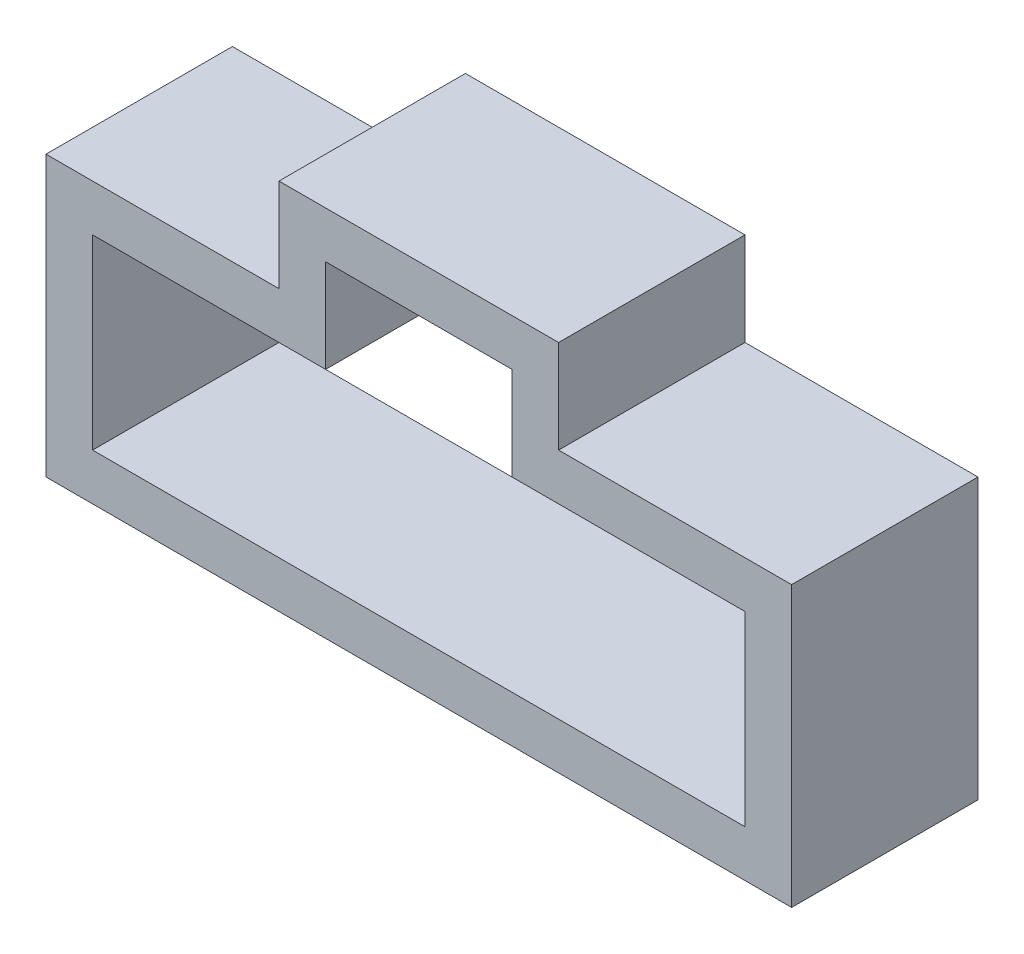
ISO-10303-21;
HEADER;
FILE_DESCRIPTION(('STEP AP214'),'2;1');
FILE_NAME('part.step','',(''),(''),'','','');
FILE_SCHEMA(('AUTOMOTIVE_DESIGN { 1 0 10303 214 1 1 1 1 }'));
ENDSEC;
DATA;
#1=APPLICATION_CONTEXT('core data for automotive mechanical design processes');
#2=APPLICATION_PROTOCOL_DEFINITION('international standard','automotive_design',2000,#1);
#3=PRODUCT_CONTEXT('',#1,'mechanical');
#4=PRODUCT('Part','Part','',(#3));
#5=PRODUCT_RELATED_PRODUCT_CATEGORY('part','',(#4));
#6=PRODUCT_DEFINITION_FORMATION('','',#4);
#7=PRODUCT_DEFINITION_CONTEXT('part definition',#1,'design');
#8=PRODUCT_DEFINITION('design','',#6,#7);
#9=PRODUCT_DEFINITION_SHAPE('','',#8);
#10=(LENGTH_UNIT() NAMED_UNIT(*) SI_UNIT(.MILLI.,.METRE.));
#11=(NAMED_UNIT(*) PLANE_ANGLE_UNIT() SI_UNIT($,.RADIAN.));
#12=(NAMED_UNIT(*) SI_UNIT($,.STERADIAN.) SOLID_ANGLE_UNIT());
#13=UNCERTAINTY_MEASURE_WITH_UNIT(LENGTH_MEASURE(1.E-05),#10,'distance_accuracy_value','');
#14=(GEOMETRIC_REPRESENTATION_CONTEXT(3) GLOBAL_UNCERTAINTY_ASSIGNED_CONTEXT((#13)) GLOBAL_UNIT_ASSIGNED_CONTEXT((#10,
#11,#12)) REPRESENTATION_CONTEXT('',''));
#15=CARTESIAN_POINT('',(0.,0.,0.));
#16=DIRECTION('',(0.,0.,1.));
#17=DIRECTION('',(1.,0.,0.));
#18=AXIS2_PLACEMENT_3D('',#15,#16,#17);
#19=CARTESIAN_POINT('',(22.5,-2.5,10.));
#20=DIRECTION('',(0.,0.,-1.));
#21=DIRECTION('',(-1.,0.,0.));
#22=AXIS2_PLACEMENT_3D('',#19,#20,#21);
#23=PLANE('',#22);
#24=DIRECTION('',(1.,0.,0.));
#25=VECTOR('',#24,1.);
#26=CARTESIAN_POINT('',(0.,-2.5,10.));
#27=LINE('',#26,#25);
#28=CARTESIAN_POINT('',(-2.5,-2.5,10.));
#29=VERTEX_POINT('',#28);
#30=CARTESIAN_POINT('',(77.5,-2.49999999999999,10.));
#31=VERTEX_POINT('',#30);
#32=EDGE_CURVE('E274',#29,#31,#27,.T.);
#33=ORIENTED_EDGE('',*,*,#32,.T.);
#34=DIRECTION('',(0.,1.,0.));
#35=VECTOR('',#34,1.);
#36=CARTESIAN_POINT('',(77.5,0.,10.));
#37=LINE('',#36,#35);
#38=CARTESIAN_POINT('',(77.5,27.5,10.));
#39=VERTEX_POINT('',#38);
#40=EDGE_CURVE('E277',#31,#39,#37,.T.);
#41=ORIENTED_EDGE('',*,*,#40,.T.);
#42=DIRECTION('',(-1.,0.,0.));
#43=VECTOR('',#42,1.);
#44=CARTESIAN_POINT('',(0.,27.5,10.));
#45=LINE('',#44,#43);
#46=CARTESIAN_POINT('',(52.5,27.5,10.));
#47=VERTEX_POINT('',#46);
#48=EDGE_CURVE('E279',#39,#47,#45,.T.);
#49=ORIENTED_EDGE('',*,*,#48,.T.);
#50=DIRECTION('',(0.,1.,0.));
#51=VECTOR('',#50,1.);
#52=CARTESIAN_POINT('',(52.5,0.,10.));
#53=LINE('',#52,#51);
#54=CARTESIAN_POINT('',(52.5,37.5,10.));
#55=VERTEX_POINT('',#54);
#56=EDGE_CURVE('E281',#47,#55,#53,.T.);
#57=ORIENTED_EDGE('',*,*,#56,.T.);
#58=DIRECTION('',(-1.,0.,0.));
#59=VECTOR('',#58,1.);
#60=CARTESIAN_POINT('',(0.,37.5,10.));
#61=LINE('',#60,#59);
#62=CARTESIAN_POINT('',(22.5,37.5,10.));
#63=VERTEX_POINT('',#62);
#64=EDGE_CURVE('E283',#55,#63,#61,.T.);
#65=ORIENTED_EDGE('',*,*,#64,.T.);
#66=DIRECTION('',(0.,-1.,0.));
#67=VECTOR('',#66,1.);
#68=CARTESIAN_POINT('',(22.5,0.,10.));
#69=LINE('',#68,#67);
#70=CARTESIAN_POINT('',(22.5,27.5,10.));
#71=VERTEX_POINT('',#70);
#72=EDGE_CURVE('E285',#63,#71,#69,.T.);
#73=ORIENTED_EDGE('',*,*,#72,.T.);
#74=DIRECTION('',(-1.,0.,0.));
#75=VECTOR('',#74,1.);
#76=CARTESIAN_POINT('',(0.,27.5,10.));
#77=LINE('',#76,#75);
#78=CARTESIAN_POINT('',(-2.5,27.5,10.));
#79=VERTEX_POINT('',#78);
#80=EDGE_CURVE('E287',#71,#79,#77,.T.);
#81=ORIENTED_EDGE('',*,*,#80,.T.);
#82=DIRECTION('',(0.,-1.,0.));
#83=VECTOR('',#82,1.);
#84=CARTESIAN_POINT('',(-2.5,0.,10.));
#85=LINE('',#84,#83);
#86=EDGE_CURVE('E289',#79,#29,#85,.T.);
#87=ORIENTED_EDGE('',*,*,#86,.T.);
#88=EDGE_LOOP('',(#33,#41,#49,#57,#65,#73,#81,#87));
#89=FACE_BOUND('',#88,.T.);
#90=DIRECTION('',(1.,0.,0.));
#91=VECTOR('',#90,1.);
#92=CARTESIAN_POINT('',(0.,2.5,10.));
#93=LINE('',#92,#91);
#94=CARTESIAN_POINT('',(2.5,2.5,10.));
#95=VERTEX_POINT('',#94);
#96=CARTESIAN_POINT('',(72.5,2.50000000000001,10.));
#97=VERTEX_POINT('',#96);
#98=EDGE_CURVE('E209',#95,#97,#93,.T.);
#99=ORIENTED_EDGE('',*,*,#98,.F.);
#100=DIRECTION('',(0.,-1.,0.));
#101=VECTOR('',#100,1.);
#102=CARTESIAN_POINT('',(2.5,0.,10.));
#103=LINE('',#102,#101);
#104=CARTESIAN_POINT('',(2.5,22.5,10.));
#105=VERTEX_POINT('',#104);
#106=EDGE_CURVE('E244',#105,#95,#103,.T.);
#107=ORIENTED_EDGE('',*,*,#106,.F.);
#108=DIRECTION('',(-1.,0.,0.));
#109=VECTOR('',#108,1.);
#110=CARTESIAN_POINT('',(0.,22.5,10.));
#111=LINE('',#110,#109);
#112=CARTESIAN_POINT('',(27.5,22.5,10.));
#113=VERTEX_POINT('',#112);
#114=EDGE_CURVE('E242',#113,#105,#111,.T.);
#115=ORIENTED_EDGE('',*,*,#114,.F.);
#116=DIRECTION('',(0.,-1.,0.));
#117=VECTOR('',#116,1.);
#118=CARTESIAN_POINT('',(27.5,0.,10.));
#119=LINE('',#118,#117);
#120=CARTESIAN_POINT('',(27.5,32.5,10.));
#121=VERTEX_POINT('',#120);
#122=EDGE_CURVE('E240',#121,#113,#119,.T.);
#123=ORIENTED_EDGE('',*,*,#122,.F.);
#124=DIRECTION('',(-1.,0.,0.));
#125=VECTOR('',#124,1.);
#126=CARTESIAN_POINT('',(0.,32.5,10.));
#127=LINE('',#126,#125);
#128=CARTESIAN_POINT('',(47.5,32.5,10.));
#129=VERTEX_POINT('',#128);
#130=EDGE_CURVE('E238',#129,#121,#127,.T.);
#131=ORIENTED_EDGE('',*,*,#130,.F.);
#132=DIRECTION('',(0.,1.,0.));
#133=VECTOR('',#132,1.);
#134=CARTESIAN_POINT('',(47.5,0.,10.));
#135=LINE('',#134,#133);
#136=CARTESIAN_POINT('',(47.5,22.5,10.));
#137=VERTEX_POINT('',#136);
#138=EDGE_CURVE('E236',#137,#129,#135,.T.);
#139=ORIENTED_EDGE('',*,*,#138,.F.);
#140=DIRECTION('',(-1.,0.,0.));
#141=VECTOR('',#140,1.);
#142=CARTESIAN_POINT('',(0.,22.5,10.));
#143=LINE('',#142,#141);
#144=CARTESIAN_POINT('',(72.5,22.5,10.));
#145=VERTEX_POINT('',#144);
#146=EDGE_CURVE('E234',#145,#137,#143,.T.);
#147=ORIENTED_EDGE('',*,*,#146,.F.);
#148=DIRECTION('',(0.,1.,0.));
#149=VECTOR('',#148,1.);
#150=CARTESIAN_POINT('',(72.5,0.,10.));
#151=LINE('',#150,#149);
#152=EDGE_CURVE('E232',#97,#145,#151,.T.);
#153=ORIENTED_EDGE('',*,*,#152,.F.);
#154=EDGE_LOOP('',(#99,#107,#115,#123,#131,#139,#147,#153));
#155=FACE_BOUND('',#154,.T.);
#156=ADVANCED_FACE('F81',(#89,#155),#23,.F.);
#157=CARTESIAN_POINT('',(22.5,-2.5,-10.));
#158=DIRECTION('',(0.,0.,-1.));
#159=DIRECTION('',(-1.,0.,0.));
#160=AXIS2_PLACEMENT_3D('',#157,#158,#159);
#161=PLANE('',#160);
#162=DIRECTION('',(1.,0.,0.));
#163=VECTOR('',#162,1.);
#164=CARTESIAN_POINT('',(0.,-2.5,-10.));
#165=LINE('',#164,#163);
#166=CARTESIAN_POINT('',(-2.5,-2.5,-10.));
#167=VERTEX_POINT('',#166);
#168=CARTESIAN_POINT('',(77.5,-2.49999999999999,-10.));
#169=VERTEX_POINT('',#168);
#170=EDGE_CURVE('E210',#167,#169,#165,.T.);
#171=ORIENTED_EDGE('',*,*,#170,.F.);
#172=DIRECTION('',(0.,-1.,0.));
#173=VECTOR('',#172,1.);
#174=CARTESIAN_POINT('',(-2.5,0.,-10.));
#175=LINE('',#174,#173);
#176=CARTESIAN_POINT('',(-2.5,27.5,-10.));
#177=VERTEX_POINT('',#176);
#178=EDGE_CURVE('E272',#177,#167,#175,.T.);
#179=ORIENTED_EDGE('',*,*,#178,.F.);
#180=DIRECTION('',(-1.,0.,0.));
#181=VECTOR('',#180,1.);
#182=CARTESIAN_POINT('',(0.,27.5,-10.));
#183=LINE('',#182,#181);
#184=CARTESIAN_POINT('',(22.5,27.5,-10.));
#185=VERTEX_POINT('',#184);
#186=EDGE_CURVE('E270',#185,#177,#183,.T.);
#187=ORIENTED_EDGE('',*,*,#186,.F.);
#188=DIRECTION('',(0.,-1.,0.));
#189=VECTOR('',#188,1.);
#190=CARTESIAN_POINT('',(22.5,0.,-10.));
#191=LINE('',#190,#189);
#192=CARTESIAN_POINT('',(22.5,37.5,-10.));
#193=VERTEX_POINT('',#192);
#194=EDGE_CURVE('E268',#193,#185,#191,.T.);
#195=ORIENTED_EDGE('',*,*,#194,.F.);
#196=DIRECTION('',(-1.,0.,0.));
#197=VECTOR('',#196,1.);
#198=CARTESIAN_POINT('',(0.,37.5,-10.));
#199=LINE('',#198,#197);
#200=CARTESIAN_POINT('',(52.5,37.5,-10.));
#201=VERTEX_POINT('',#200);
#202=EDGE_CURVE('E266',#201,#193,#199,.T.);
#203=ORIENTED_EDGE('',*,*,#202,.F.);
#204=DIRECTION('',(0.,1.,0.));
#205=VECTOR('',#204,1.);
#206=CARTESIAN_POINT('',(52.5,0.,-10.));
#207=LINE('',#206,#205);
#208=CARTESIAN_POINT('',(52.5,27.5,-10.));
#209=VERTEX_POINT('',#208);
#210=EDGE_CURVE('E264',#209,#201,#207,.T.);
#211=ORIENTED_EDGE('',*,*,#210,.F.);
#212=DIRECTION('',(-1.,0.,0.));
#213=VECTOR('',#212,1.);
#214=CARTESIAN_POINT('',(0.,27.5,-10.));
#215=LINE('',#214,#213);
#216=CARTESIAN_POINT('',(77.5,27.5,-10.));
#217=VERTEX_POINT('',#216);
#218=EDGE_CURVE('E262',#217,#209,#215,.T.);
#219=ORIENTED_EDGE('',*,*,#218,.F.);
#220=DIRECTION('',(0.,1.,0.));
#221=VECTOR('',#220,1.);
#222=CARTESIAN_POINT('',(77.5,0.,-10.));
#223=LINE('',#222,#221);
#224=EDGE_CURVE('E260',#169,#217,#223,.T.);
#225=ORIENTED_EDGE('',*,*,#224,.F.);
#226=EDGE_LOOP('',(#171,#179,#187,#195,#203,#211,#219,#225));
#227=FACE_BOUND('',#226,.T.);
#228=DIRECTION('',(0.,-1.,0.));
#229=VECTOR('',#228,1.);
#230=CARTESIAN_POINT('',(2.5,0.,-10.));
#231=LINE('',#230,#229);
#232=CARTESIAN_POINT('',(2.5,22.5,-10.));
#233=VERTEX_POINT('',#232);
#234=CARTESIAN_POINT('',(2.5,2.5,-10.));
#235=VERTEX_POINT('',#234);
#236=EDGE_CURVE('E215',#233,#235,#231,.T.);
#237=ORIENTED_EDGE('',*,*,#236,.T.);
#238=DIRECTION('',(1.,0.,0.));
#239=VECTOR('',#238,1.);
#240=CARTESIAN_POINT('',(0.,2.5,-10.));
#241=LINE('',#240,#239);
#242=CARTESIAN_POINT('',(72.5,2.50000000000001,-10.));
#243=VERTEX_POINT('',#242);
#244=EDGE_CURVE('E104',#235,#243,#241,.T.);
#245=ORIENTED_EDGE('',*,*,#244,.T.);
#246=DIRECTION('',(0.,1.,0.));
#247=VECTOR('',#246,1.);
#248=CARTESIAN_POINT('',(72.5,0.,-10.));
#249=LINE('',#248,#247);
#250=CARTESIAN_POINT('',(72.5,22.5,-10.));
#251=VERTEX_POINT('',#250);
#252=EDGE_CURVE('E196',#243,#251,#249,.T.);
#253=ORIENTED_EDGE('',*,*,#252,.T.);
#254=DIRECTION('',(-1.,0.,0.));
#255=VECTOR('',#254,1.);
#256=CARTESIAN_POINT('',(0.,22.5,-10.));
#257=LINE('',#256,#255);
#258=CARTESIAN_POINT('',(47.5,22.5,-10.));
#259=VERTEX_POINT('',#258);
#260=EDGE_CURVE('E205',#251,#259,#257,.T.);
#261=ORIENTED_EDGE('',*,*,#260,.T.);
#262=DIRECTION('',(0.,1.,0.));
#263=VECTOR('',#262,1.);
#264=CARTESIAN_POINT('',(47.5,0.,-10.));
#265=LINE('',#264,#263);
#266=CARTESIAN_POINT('',(47.5,32.5,-10.));
#267=VERTEX_POINT('',#266);
#268=EDGE_CURVE('E219',#259,#267,#265,.T.);
#269=ORIENTED_EDGE('',*,*,#268,.T.);
#270=DIRECTION('',(-1.,0.,0.));
#271=VECTOR('',#270,1.);
#272=CARTESIAN_POINT('',(0.,32.5,-10.));
#273=LINE('',#272,#271);
#274=CARTESIAN_POINT('',(27.5,32.5,-10.));
#275=VERTEX_POINT('',#274);
#276=EDGE_CURVE('E222',#267,#275,#273,.T.);
#277=ORIENTED_EDGE('',*,*,#276,.T.);
#278=DIRECTION('',(0.,-1.,0.));
#279=VECTOR('',#278,1.);
#280=CARTESIAN_POINT('',(27.5,0.,-10.));
#281=LINE('',#280,#279);
#282=CARTESIAN_POINT('',(27.5,22.5,-10.));
#283=VERTEX_POINT('',#282);
#284=EDGE_CURVE('E225',#275,#283,#281,.T.);
#285=ORIENTED_EDGE('',*,*,#284,.T.);
#286=DIRECTION('',(-1.,0.,0.));
#287=VECTOR('',#286,1.);
#288=CARTESIAN_POINT('',(0.,22.5,-10.));
#289=LINE('',#288,#287);
#290=EDGE_CURVE('E228',#283,#233,#289,.T.);
#291=ORIENTED_EDGE('',*,*,#290,.T.);
#292=EDGE_LOOP('',(#237,#245,#253,#261,#269,#277,#285,#291));
#293=FACE_BOUND('',#292,.T.);
#294=ADVANCED_FACE('F213',(#227,#293),#161,.T.);
#295=CARTESIAN_POINT('',(0.,-2.5,10.));
#296=DIRECTION('',(0.,1.,0.));
#297=DIRECTION('',(-1.,0.,0.));
#298=AXIS2_PLACEMENT_3D('',#295,#296,#297);
#299=PLANE('',#298);
#300=ORIENTED_EDGE('',*,*,#170,.T.);
#301=DIRECTION('',(0.,0.,-1.));
#302=VECTOR('',#301,1.);
#303=CARTESIAN_POINT('',(77.5,-2.49999999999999,10.));
#304=LINE('',#303,#302);
#305=EDGE_CURVE('E12',#31,#169,#304,.T.);
#306=ORIENTED_EDGE('',*,*,#305,.F.);
#307=ORIENTED_EDGE('',*,*,#32,.F.);
#308=DIRECTION('',(0.,0.,-1.));
#309=VECTOR('',#308,1.);
#310=CARTESIAN_POINT('',(-2.5,-2.5,10.));
#311=LINE('',#310,#309);
#312=EDGE_CURVE('E291',#29,#167,#311,.T.);
#313=ORIENTED_EDGE('',*,*,#312,.T.);
#314=EDGE_LOOP('',(#300,#306,#307,#313));
#315=FACE_BOUND('',#314,.T.);
#316=ADVANCED_FACE('F83',(#315),#299,.F.);
#317=CARTESIAN_POINT('',(77.5,0.,10.));
#318=DIRECTION('',(-1.,0.,0.));
#319=DIRECTION('',(0.,-1.,0.));
#320=AXIS2_PLACEMENT_3D('',#317,#318,#319);
#321=PLANE('',#320);
#322=ORIENTED_EDGE('',*,*,#224,.T.);
#323=DIRECTION('',(0.,0.,-1.));
#324=VECTOR('',#323,1.);
#325=CARTESIAN_POINT('',(77.5,27.5,10.));
#326=LINE('',#325,#324);
#327=EDGE_CURVE('E89',#39,#217,#326,.T.);
#328=ORIENTED_EDGE('',*,*,#327,.F.);
#329=ORIENTED_EDGE('',*,*,#40,.F.);
#330=ORIENTED_EDGE('',*,*,#305,.T.);
#331=EDGE_LOOP('',(#322,#328,#329,#330));
#332=FACE_BOUND('',#331,.T.);
#333=ADVANCED_FACE('F335',(#332),#321,.F.);
#334=CARTESIAN_POINT('',(0.,27.5,10.));
#335=DIRECTION('',(0.,-1.,0.));
#336=DIRECTION('',(1.,0.,0.));
#337=AXIS2_PLACEMENT_3D('',#334,#335,#336);
#338=PLANE('',#337);
#339=ORIENTED_EDGE('',*,*,#218,.T.);
#340=DIRECTION('',(0.,0.,-1.));
#341=VECTOR('',#340,1.);
#342=CARTESIAN_POINT('',(52.5,27.5,10.));
#343=LINE('',#342,#341);
#344=EDGE_CURVE('E306',#47,#209,#343,.T.);
#345=ORIENTED_EDGE('',*,*,#344,.F.);
#346=ORIENTED_EDGE('',*,*,#48,.F.);
#347=ORIENTED_EDGE('',*,*,#327,.T.);
#348=EDGE_LOOP('',(#339,#345,#346,#347));
#349=FACE_BOUND('',#348,.T.);
#350=ADVANCED_FACE('F313',(#349),#338,.F.);
#351=CARTESIAN_POINT('',(52.5,0.,10.));
#352=DIRECTION('',(-1.,0.,0.));
#353=DIRECTION('',(0.,-1.,0.));
#354=AXIS2_PLACEMENT_3D('',#351,#352,#353);
#355=PLANE('',#354);
#356=ORIENTED_EDGE('',*,*,#210,.T.);
#357=DIRECTION('',(0.,0.,-1.));
#358=VECTOR('',#357,1.);
#359=CARTESIAN_POINT('',(52.5,37.5,10.));
#360=LINE('',#359,#358);
#361=EDGE_CURVE('E303',#55,#201,#360,.T.);
#362=ORIENTED_EDGE('',*,*,#361,.F.);
#363=ORIENTED_EDGE('',*,*,#56,.F.);
#364=ORIENTED_EDGE('',*,*,#344,.T.);
#365=EDGE_LOOP('',(#356,#362,#363,#364));
#366=FACE_BOUND('',#365,.T.);
#367=ADVANCED_FACE('F323',(#366),#355,.F.);
#368=CARTESIAN_POINT('',(0.,37.5,10.));
#369=DIRECTION('',(0.,-1.,0.));
#370=DIRECTION('',(0.,0.,-1.));
#371=AXIS2_PLACEMENT_3D('',#368,#369,#370);
#372=PLANE('',#371);
#373=ORIENTED_EDGE('',*,*,#202,.T.);
#374=DIRECTION('',(0.,0.,-1.));
#375=VECTOR('',#374,1.);
#376=CARTESIAN_POINT('',(22.5,37.5,10.));
#377=LINE('',#376,#375);
#378=EDGE_CURVE('E300',#63,#193,#377,.T.);
#379=ORIENTED_EDGE('',*,*,#378,.F.);
#380=ORIENTED_EDGE('',*,*,#64,.F.);
#381=ORIENTED_EDGE('',*,*,#361,.T.);
#382=EDGE_LOOP('',(#373,#379,#380,#381));
#383=FACE_BOUND('',#382,.T.);
#384=ADVANCED_FACE('F327',(#383),#372,.F.);
#385=CARTESIAN_POINT('',(22.5,0.,10.));
#386=DIRECTION('',(1.,0.,0.));
#387=DIRECTION('',(0.,0.,-1.));
#388=AXIS2_PLACEMENT_3D('',#385,#386,#387);
#389=PLANE('',#388);
#390=ORIENTED_EDGE('',*,*,#194,.T.);
#391=DIRECTION('',(0.,0.,-1.));
#392=VECTOR('',#391,1.);
#393=CARTESIAN_POINT('',(22.5,27.5,10.));
#394=LINE('',#393,#392);
#395=EDGE_CURVE('E297',#71,#185,#394,.T.);
#396=ORIENTED_EDGE('',*,*,#395,.F.);
#397=ORIENTED_EDGE('',*,*,#72,.F.);
#398=ORIENTED_EDGE('',*,*,#378,.T.);
#399=EDGE_LOOP('',(#390,#396,#397,#398));
#400=FACE_BOUND('',#399,.T.);
#401=ADVANCED_FACE('F348',(#400),#389,.F.);
#402=CARTESIAN_POINT('',(0.,27.5,10.));
#403=DIRECTION('',(0.,-1.,0.));
#404=DIRECTION('',(0.,0.,-1.));
#405=AXIS2_PLACEMENT_3D('',#402,#403,#404);
#406=PLANE('',#405);
#407=ORIENTED_EDGE('',*,*,#186,.T.);
#408=DIRECTION('',(0.,0.,-1.));
#409=VECTOR('',#408,1.);
#410=CARTESIAN_POINT('',(-2.5,27.5,10.));
#411=LINE('',#410,#409);
#412=EDGE_CURVE('E294',#79,#177,#411,.T.);
#413=ORIENTED_EDGE('',*,*,#412,.F.);
#414=ORIENTED_EDGE('',*,*,#80,.F.);
#415=ORIENTED_EDGE('',*,*,#395,.T.);
#416=EDGE_LOOP('',(#407,#413,#414,#415));
#417=FACE_BOUND('',#416,.T.);
#418=ADVANCED_FACE('F346',(#417),#406,.F.);
#419=CARTESIAN_POINT('',(-2.5,0.,10.));
#420=DIRECTION('',(1.,0.,0.));
#421=DIRECTION('',(0.,0.,-1.));
#422=AXIS2_PLACEMENT_3D('',#419,#420,#421);
#423=PLANE('',#422);
#424=ORIENTED_EDGE('',*,*,#178,.T.);
#425=ORIENTED_EDGE('',*,*,#312,.F.);
#426=ORIENTED_EDGE('',*,*,#86,.F.);
#427=ORIENTED_EDGE('',*,*,#412,.T.);
#428=EDGE_LOOP('',(#424,#425,#426,#427));
#429=FACE_BOUND('',#428,.T.);
#430=ADVANCED_FACE('F341',(#429),#423,.F.);
#431=CARTESIAN_POINT('',(0.,2.5,10.));
#432=DIRECTION('',(0.,1.,0.));
#433=DIRECTION('',(-1.,0.,0.));
#434=AXIS2_PLACEMENT_3D('',#431,#432,#433);
#435=PLANE('',#434);
#436=ORIENTED_EDGE('',*,*,#244,.F.);
#437=DIRECTION('',(0.,0.,-1.));
#438=VECTOR('',#437,1.);
#439=CARTESIAN_POINT('',(2.5,2.5,10.));
#440=LINE('',#439,#438);
#441=EDGE_CURVE('E246',#95,#235,#440,.T.);
#442=ORIENTED_EDGE('',*,*,#441,.F.);
#443=ORIENTED_EDGE('',*,*,#98,.T.);
#444=DIRECTION('',(0.,0.,-1.));
#445=VECTOR('',#444,1.);
#446=CARTESIAN_POINT('',(72.5,2.50000000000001,10.));
#447=LINE('',#446,#445);
#448=EDGE_CURVE('E198',#97,#243,#447,.T.);
#449=ORIENTED_EDGE('',*,*,#448,.T.);
#450=EDGE_LOOP('',(#436,#442,#443,#449));
#451=FACE_BOUND('',#450,.T.);
#452=ADVANCED_FACE('F207',(#451),#435,.T.);
#453=CARTESIAN_POINT('',(72.5,0.,10.));
#454=DIRECTION('',(-1.,0.,0.));
#455=DIRECTION('',(0.,-1.,0.));
#456=AXIS2_PLACEMENT_3D('',#453,#454,#455);
#457=PLANE('',#456);
#458=ORIENTED_EDGE('',*,*,#252,.F.);
#459=ORIENTED_EDGE('',*,*,#448,.F.);
#460=ORIENTED_EDGE('',*,*,#152,.T.);
#461=DIRECTION('',(0.,0.,-1.));
#462=VECTOR('',#461,1.);
#463=CARTESIAN_POINT('',(72.5,22.5,10.));
#464=LINE('',#463,#462);
#465=EDGE_CURVE('E201',#145,#251,#464,.T.);
#466=ORIENTED_EDGE('',*,*,#465,.T.);
#467=EDGE_LOOP('',(#458,#459,#460,#466));
#468=FACE_BOUND('',#467,.T.);
#469=ADVANCED_FACE('F197',(#468),#457,.T.);
#470=CARTESIAN_POINT('',(0.,22.5,10.));
#471=DIRECTION('',(0.,-1.,0.));
#472=DIRECTION('',(1.,0.,0.));
#473=AXIS2_PLACEMENT_3D('',#470,#471,#472);
#474=PLANE('',#473);
#475=ORIENTED_EDGE('',*,*,#260,.F.);
#476=ORIENTED_EDGE('',*,*,#465,.F.);
#477=ORIENTED_EDGE('',*,*,#146,.T.);
#478=DIRECTION('',(0.,0.,-1.));
#479=VECTOR('',#478,1.);
#480=CARTESIAN_POINT('',(47.5,22.5,10.));
#481=LINE('',#480,#479);
#482=EDGE_CURVE('E255',#137,#259,#481,.T.);
#483=ORIENTED_EDGE('',*,*,#482,.T.);
#484=EDGE_LOOP('',(#475,#476,#477,#483));
#485=FACE_BOUND('',#484,.T.);
#486=ADVANCED_FACE('F372',(#485),#474,.T.);
#487=CARTESIAN_POINT('',(47.5,0.,10.));
#488=DIRECTION('',(-1.,0.,0.));
#489=DIRECTION('',(0.,-1.,0.));
#490=AXIS2_PLACEMENT_3D('',#487,#488,#489);
#491=PLANE('',#490);
#492=ORIENTED_EDGE('',*,*,#268,.F.);
#493=ORIENTED_EDGE('',*,*,#482,.F.);
#494=ORIENTED_EDGE('',*,*,#138,.T.);
#495=DIRECTION('',(0.,0.,-1.));
#496=VECTOR('',#495,1.);
#497=CARTESIAN_POINT('',(47.5,32.5,10.));
#498=LINE('',#497,#496);
#499=EDGE_CURVE('E253',#129,#267,#498,.T.);
#500=ORIENTED_EDGE('',*,*,#499,.T.);
#501=EDGE_LOOP('',(#492,#493,#494,#500));
#502=FACE_BOUND('',#501,.T.);
#503=ADVANCED_FACE('F377',(#502),#491,.T.);
#504=CARTESIAN_POINT('',(0.,32.5,10.));
#505=DIRECTION('',(0.,-1.,0.));
#506=DIRECTION('',(0.,0.,-1.));
#507=AXIS2_PLACEMENT_3D('',#504,#505,#506);
#508=PLANE('',#507);
#509=ORIENTED_EDGE('',*,*,#276,.F.);
#510=ORIENTED_EDGE('',*,*,#499,.F.);
#511=ORIENTED_EDGE('',*,*,#130,.T.);
#512=DIRECTION('',(0.,0.,-1.));
#513=VECTOR('',#512,1.);
#514=CARTESIAN_POINT('',(27.5,32.5,10.));
#515=LINE('',#514,#513);
#516=EDGE_CURVE('E251',#121,#275,#515,.T.);
#517=ORIENTED_EDGE('',*,*,#516,.T.);
#518=EDGE_LOOP('',(#509,#510,#511,#517));
#519=FACE_BOUND('',#518,.T.);
#520=ADVANCED_FACE('F381',(#519),#508,.T.);
#521=CARTESIAN_POINT('',(27.5,0.,10.));
#522=DIRECTION('',(1.,0.,0.));
#523=DIRECTION('',(0.,0.,-1.));
#524=AXIS2_PLACEMENT_3D('',#521,#522,#523);
#525=PLANE('',#524);
#526=ORIENTED_EDGE('',*,*,#284,.F.);
#527=ORIENTED_EDGE('',*,*,#516,.F.);
#528=ORIENTED_EDGE('',*,*,#122,.T.);
#529=DIRECTION('',(0.,0.,-1.));
#530=VECTOR('',#529,1.);
#531=CARTESIAN_POINT('',(27.5,22.5,10.));
#532=LINE('',#531,#530);
#533=EDGE_CURVE('E249',#113,#283,#532,.T.);
#534=ORIENTED_EDGE('',*,*,#533,.T.);
#535=EDGE_LOOP('',(#526,#527,#528,#534));
#536=FACE_BOUND('',#535,.T.);
#537=ADVANCED_FACE('F385',(#536),#525,.T.);
#538=CARTESIAN_POINT('',(0.,22.5,10.));
#539=DIRECTION('',(0.,-1.,0.));
#540=DIRECTION('',(0.,0.,-1.));
#541=AXIS2_PLACEMENT_3D('',#538,#539,#540);
#542=PLANE('',#541);
#543=ORIENTED_EDGE('',*,*,#290,.F.);
#544=ORIENTED_EDGE('',*,*,#533,.F.);
#545=ORIENTED_EDGE('',*,*,#114,.T.);
#546=DIRECTION('',(0.,0.,-1.));
#547=VECTOR('',#546,1.);
#548=CARTESIAN_POINT('',(2.5,22.5,10.));
#549=LINE('',#548,#547);
#550=EDGE_CURVE('E96',#105,#233,#549,.T.);
#551=ORIENTED_EDGE('',*,*,#550,.T.);
#552=EDGE_LOOP('',(#543,#544,#545,#551));
#553=FACE_BOUND('',#552,.T.);
#554=ADVANCED_FACE('F389',(#553),#542,.T.);
#555=CARTESIAN_POINT('',(2.5,0.,10.));
#556=DIRECTION('',(1.,0.,0.));
#557=DIRECTION('',(0.,0.,-1.));
#558=AXIS2_PLACEMENT_3D('',#555,#556,#557);
#559=PLANE('',#558);
#560=ORIENTED_EDGE('',*,*,#236,.F.);
#561=ORIENTED_EDGE('',*,*,#550,.F.);
#562=ORIENTED_EDGE('',*,*,#106,.T.);
#563=ORIENTED_EDGE('',*,*,#441,.T.);
#564=EDGE_LOOP('',(#560,#561,#562,#563));
#565=FACE_BOUND('',#564,.T.);
#566=ADVANCED_FACE('F393',(#565),#559,.T.);
#567=CLOSED_SHELL('',(#156,#294,#316,#333,#350,#367,#384,#401,#418,#430,#452,#469,#486,#503,
#520,#537,#554,#566));
#568=MANIFOLD_SOLID_BREP('B2',#567);
#569=ADVANCED_BREP_SHAPE_REPRESENTATION('',(#18,#568),#14);
#570=SHAPE_DEFINITION_REPRESENTATION(#9,#569);
ENDSEC;
END-ISO-10303-21;
